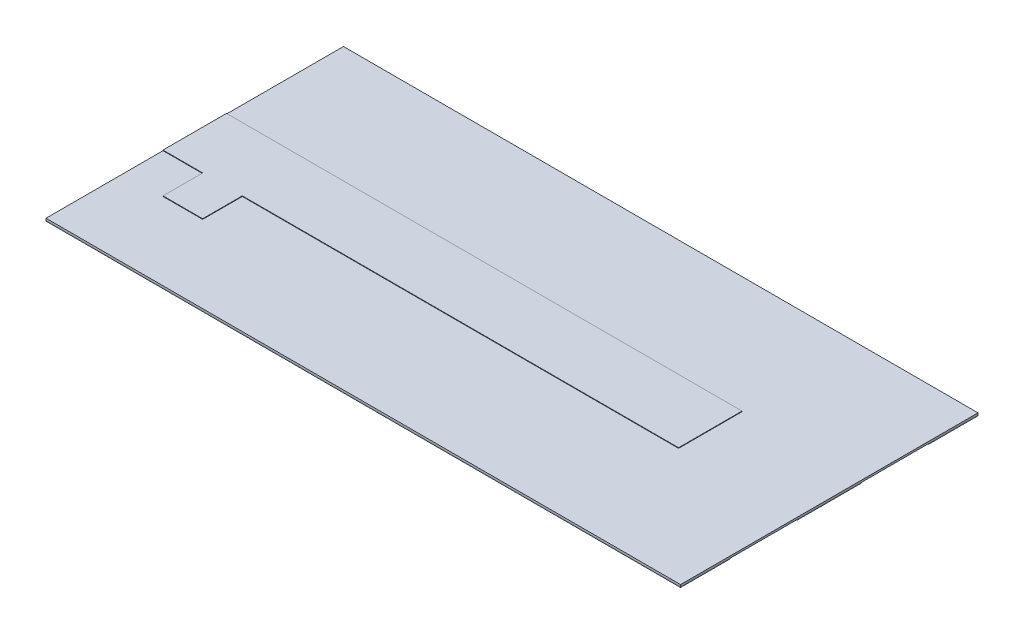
ISO-10303-21;
HEADER;
FILE_DESCRIPTION(('STEP AP214'),'2;1');
FILE_NAME('part.step','',(''),(''),'','','');
FILE_SCHEMA(('AUTOMOTIVE_DESIGN { 1 0 10303 214 1 1 1 1 }'));
ENDSEC;
DATA;
#1=APPLICATION_CONTEXT('core data for automotive mechanical design processes');
#2=APPLICATION_PROTOCOL_DEFINITION('international standard','automotive_design',2000,#1);
#3=PRODUCT_CONTEXT('',#1,'mechanical');
#4=PRODUCT('Part','Part','',(#3));
#5=PRODUCT_RELATED_PRODUCT_CATEGORY('part','',(#4));
#6=PRODUCT_DEFINITION_FORMATION('','',#4);
#7=PRODUCT_DEFINITION_CONTEXT('part definition',#1,'design');
#8=PRODUCT_DEFINITION('design','',#6,#7);
#9=PRODUCT_DEFINITION_SHAPE('','',#8);
#10=(LENGTH_UNIT() NAMED_UNIT(*) SI_UNIT(.MILLI.,.METRE.));
#11=(NAMED_UNIT(*) PLANE_ANGLE_UNIT() SI_UNIT($,.RADIAN.));
#12=(NAMED_UNIT(*) SI_UNIT($,.STERADIAN.) SOLID_ANGLE_UNIT());
#13=UNCERTAINTY_MEASURE_WITH_UNIT(LENGTH_MEASURE(1.E-05),#10,'distance_accuracy_value','');
#14=(GEOMETRIC_REPRESENTATION_CONTEXT(3) GLOBAL_UNCERTAINTY_ASSIGNED_CONTEXT((#13)) GLOBAL_UNIT_ASSIGNED_CONTEXT((#10,
#11,#12)) REPRESENTATION_CONTEXT('',''));
#15=CARTESIAN_POINT('',(0.,0.,0.));
#16=DIRECTION('',(0.,0.,1.));
#17=DIRECTION('',(1.,0.,0.));
#18=AXIS2_PLACEMENT_3D('',#15,#16,#17);
#19=CARTESIAN_POINT('',(20.32,-0.03556,-9.525));
#20=DIRECTION('',(0.,0.,1.));
#21=DIRECTION('',(1.,0.,0.));
#22=AXIS2_PLACEMENT_3D('',#19,#20,#21);
#23=PLANE('',#22);
#24=DIRECTION('',(1.,0.,0.));
#25=VECTOR('',#24,1.);
#26=CARTESIAN_POINT('',(20.32,0.,-9.525));
#27=LINE('',#26,#25);
#28=CARTESIAN_POINT('',(-20.32,0.,-9.525));
#29=VERTEX_POINT('',#28);
#30=CARTESIAN_POINT('',(20.32,0.,-9.525));
#31=VERTEX_POINT('',#30);
#32=EDGE_CURVE('E114',#29,#31,#27,.T.);
#33=ORIENTED_EDGE('',*,*,#32,.T.);
#34=DIRECTION('',(0.,1.,0.));
#35=VECTOR('',#34,1.);
#36=CARTESIAN_POINT('',(20.32,-0.03556,-9.525));
#37=LINE('',#36,#35);
#38=CARTESIAN_POINT('',(20.32,-0.03556,-9.525));
#39=VERTEX_POINT('',#38);
#40=EDGE_CURVE('E12',#39,#31,#37,.T.);
#41=ORIENTED_EDGE('',*,*,#40,.F.);
#42=DIRECTION('',(1.,0.,0.));
#43=VECTOR('',#42,1.);
#44=CARTESIAN_POINT('',(20.32,-0.03556,-9.525));
#45=LINE('',#44,#43);
#46=CARTESIAN_POINT('',(-20.32,-0.03556,-9.525));
#47=VERTEX_POINT('',#46);
#48=EDGE_CURVE('E102',#47,#39,#45,.T.);
#49=ORIENTED_EDGE('',*,*,#48,.F.);
#50=DIRECTION('',(0.,1.,0.));
#51=VECTOR('',#50,1.);
#52=CARTESIAN_POINT('',(-20.32,-0.03556,-9.525));
#53=LINE('',#52,#51);
#54=EDGE_CURVE('E110',#47,#29,#53,.T.);
#55=ORIENTED_EDGE('',*,*,#54,.T.);
#56=EDGE_LOOP('',(#33,#41,#49,#55));
#57=FACE_BOUND('',#56,.T.);
#58=ADVANCED_FACE('F51',(#57),#23,.F.);
#59=CARTESIAN_POINT('',(20.32,-0.03556,-6.35));
#60=DIRECTION('',(-1.,0.,0.));
#61=DIRECTION('',(0.,0.,1.));
#62=AXIS2_PLACEMENT_3D('',#59,#60,#61);
#63=PLANE('',#62);
#64=DIRECTION('',(0.,0.,1.));
#65=VECTOR('',#64,1.);
#66=CARTESIAN_POINT('',(20.32,0.,-6.35));
#67=LINE('',#66,#65);
#68=CARTESIAN_POINT('',(20.32,0.,-6.35));
#69=VERTEX_POINT('',#68);
#70=EDGE_CURVE('E106',#31,#69,#67,.T.);
#71=ORIENTED_EDGE('',*,*,#70,.T.);
#72=DIRECTION('',(0.,1.,0.));
#73=VECTOR('',#72,1.);
#74=CARTESIAN_POINT('',(20.32,-0.03556,-6.35));
#75=LINE('',#74,#73);
#76=CARTESIAN_POINT('',(20.32,-0.03556,-6.35));
#77=VERTEX_POINT('',#76);
#78=EDGE_CURVE('E59',#77,#69,#75,.T.);
#79=ORIENTED_EDGE('',*,*,#78,.F.);
#80=DIRECTION('',(0.,0.,1.));
#81=VECTOR('',#80,1.);
#82=CARTESIAN_POINT('',(20.32,-0.03556,-6.35));
#83=LINE('',#82,#81);
#84=EDGE_CURVE('E97',#39,#77,#83,.T.);
#85=ORIENTED_EDGE('',*,*,#84,.F.);
#86=ORIENTED_EDGE('',*,*,#40,.T.);
#87=EDGE_LOOP('',(#71,#79,#85,#86));
#88=FACE_BOUND('',#87,.T.);
#89=ADVANCED_FACE('F105',(#88),#63,.F.);
#90=CARTESIAN_POINT('',(-20.32,-0.03556,-6.35));
#91=DIRECTION('',(0.,0.,-1.));
#92=DIRECTION('',(-1.,0.,0.));
#93=AXIS2_PLACEMENT_3D('',#90,#91,#92);
#94=PLANE('',#93);
#95=DIRECTION('',(-1.,0.,0.));
#96=VECTOR('',#95,1.);
#97=CARTESIAN_POINT('',(-20.32,0.,-6.35));
#98=LINE('',#97,#96);
#99=CARTESIAN_POINT('',(-20.32,0.,-6.35));
#100=VERTEX_POINT('',#99);
#101=EDGE_CURVE('E84',#69,#100,#98,.T.);
#102=ORIENTED_EDGE('',*,*,#101,.T.);
#103=DIRECTION('',(0.,1.,0.));
#104=VECTOR('',#103,1.);
#105=CARTESIAN_POINT('',(-20.32,-0.03556,-6.35));
#106=LINE('',#105,#104);
#107=CARTESIAN_POINT('',(-20.32,-0.03556,-6.35));
#108=VERTEX_POINT('',#107);
#109=EDGE_CURVE('E107',#108,#100,#106,.T.);
#110=ORIENTED_EDGE('',*,*,#109,.F.);
#111=DIRECTION('',(-1.,0.,0.));
#112=VECTOR('',#111,1.);
#113=CARTESIAN_POINT('',(-20.32,-0.03556,-6.35));
#114=LINE('',#113,#112);
#115=EDGE_CURVE('E100',#77,#108,#114,.T.);
#116=ORIENTED_EDGE('',*,*,#115,.F.);
#117=ORIENTED_EDGE('',*,*,#78,.T.);
#118=EDGE_LOOP('',(#102,#110,#116,#117));
#119=FACE_BOUND('',#118,.T.);
#120=ADVANCED_FACE('F108',(#119),#94,.F.);
#121=CARTESIAN_POINT('',(-20.32,-0.03556,-9.525));
#122=DIRECTION('',(1.,0.,0.));
#123=DIRECTION('',(0.,0.,-1.));
#124=AXIS2_PLACEMENT_3D('',#121,#122,#123);
#125=PLANE('',#124);
#126=DIRECTION('',(0.,0.,-1.));
#127=VECTOR('',#126,1.);
#128=CARTESIAN_POINT('',(-20.32,0.,-9.525));
#129=LINE('',#128,#127);
#130=EDGE_CURVE('E90',#100,#29,#129,.T.);
#131=ORIENTED_EDGE('',*,*,#130,.T.);
#132=ORIENTED_EDGE('',*,*,#54,.F.);
#133=DIRECTION('',(0.,0.,-1.));
#134=VECTOR('',#133,1.);
#135=CARTESIAN_POINT('',(-20.32,-0.03556,-9.525));
#136=LINE('',#135,#134);
#137=EDGE_CURVE('E67',#108,#47,#136,.T.);
#138=ORIENTED_EDGE('',*,*,#137,.F.);
#139=ORIENTED_EDGE('',*,*,#109,.T.);
#140=EDGE_LOOP('',(#131,#132,#138,#139));
#141=FACE_BOUND('',#140,.T.);
#142=ADVANCED_FACE('F121',(#141),#125,.F.);
#143=CARTESIAN_POINT('',(0.,-0.03556,0.));
#144=DIRECTION('',(0.,1.,0.));
#145=DIRECTION('',(0.,0.,1.));
#146=AXIS2_PLACEMENT_3D('',#143,#144,#145);
#147=PLANE('',#146);
#148=ORIENTED_EDGE('',*,*,#48,.T.);
#149=ORIENTED_EDGE('',*,*,#84,.T.);
#150=ORIENTED_EDGE('',*,*,#115,.T.);
#151=ORIENTED_EDGE('',*,*,#137,.T.);
#152=EDGE_LOOP('',(#148,#149,#150,#151));
#153=FACE_BOUND('',#152,.T.);
#154=ADVANCED_FACE('F98',(#153),#147,.F.);
#155=CARTESIAN_POINT('',(0.,0.,0.));
#156=DIRECTION('',(0.,1.,0.));
#157=DIRECTION('',(0.,0.,1.));
#158=AXIS2_PLACEMENT_3D('',#155,#156,#157);
#159=PLANE('',#158);
#160=ORIENTED_EDGE('',*,*,#32,.F.);
#161=ORIENTED_EDGE('',*,*,#130,.F.);
#162=ORIENTED_EDGE('',*,*,#101,.F.);
#163=ORIENTED_EDGE('',*,*,#70,.F.);
#164=EDGE_LOOP('',(#160,#161,#162,#163));
#165=FACE_BOUND('',#164,.T.);
#166=ADVANCED_FACE('F124',(#165),#159,.T.);
#167=CLOSED_SHELL('',(#58,#89,#120,#142,#154,#166));
#168=MANIFOLD_SOLID_BREP('B2',#167);
#169=CARTESIAN_POINT('',(20.32,-0.03556,6.35));
#170=DIRECTION('',(-1.,0.,0.));
#171=DIRECTION('',(0.,0.,1.));
#172=AXIS2_PLACEMENT_3D('',#169,#170,#171);
#173=PLANE('',#172);
#174=DIRECTION('',(0.,0.,1.));
#175=VECTOR('',#174,1.);
#176=CARTESIAN_POINT('',(20.32,0.,6.35));
#177=LINE('',#176,#175);
#178=CARTESIAN_POINT('',(20.32,0.,6.35));
#179=VERTEX_POINT('',#178);
#180=CARTESIAN_POINT('',(20.32,0.,9.525));
#181=VERTEX_POINT('',#180);
#182=EDGE_CURVE('E247',#179,#181,#177,.T.);
#183=ORIENTED_EDGE('',*,*,#182,.T.);
#184=DIRECTION('',(0.,1.,0.));
#185=VECTOR('',#184,1.);
#186=CARTESIAN_POINT('',(20.32,-0.03556,9.525));
#187=LINE('',#186,#185);
#188=CARTESIAN_POINT('',(20.32,-0.03556,9.525));
#189=VERTEX_POINT('',#188);
#190=EDGE_CURVE('E49',#189,#181,#187,.T.);
#191=ORIENTED_EDGE('',*,*,#190,.F.);
#192=DIRECTION('',(0.,0.,1.));
#193=VECTOR('',#192,1.);
#194=CARTESIAN_POINT('',(20.32,-0.03556,6.35));
#195=LINE('',#194,#193);
#196=CARTESIAN_POINT('',(20.32,-0.03556,6.35));
#197=VERTEX_POINT('',#196);
#198=EDGE_CURVE('E235',#197,#189,#195,.T.);
#199=ORIENTED_EDGE('',*,*,#198,.F.);
#200=DIRECTION('',(0.,1.,0.));
#201=VECTOR('',#200,1.);
#202=CARTESIAN_POINT('',(20.32,-0.03556,6.35));
#203=LINE('',#202,#201);
#204=EDGE_CURVE('E243',#197,#179,#203,.T.);
#205=ORIENTED_EDGE('',*,*,#204,.T.);
#206=EDGE_LOOP('',(#183,#191,#199,#205));
#207=FACE_BOUND('',#206,.T.);
#208=ADVANCED_FACE('F184',(#207),#173,.F.);
#209=CARTESIAN_POINT('',(20.32,-0.03556,9.525));
#210=DIRECTION('',(0.,0.,-1.));
#211=DIRECTION('',(-1.,0.,0.));
#212=AXIS2_PLACEMENT_3D('',#209,#210,#211);
#213=PLANE('',#212);
#214=DIRECTION('',(-1.,0.,0.));
#215=VECTOR('',#214,1.);
#216=CARTESIAN_POINT('',(20.32,0.,9.525));
#217=LINE('',#216,#215);
#218=CARTESIAN_POINT('',(-20.32,0.,9.525));
#219=VERTEX_POINT('',#218);
#220=EDGE_CURVE('E239',#181,#219,#217,.T.);
#221=ORIENTED_EDGE('',*,*,#220,.T.);
#222=DIRECTION('',(0.,1.,0.));
#223=VECTOR('',#222,1.);
#224=CARTESIAN_POINT('',(-20.32,-0.03556,9.525));
#225=LINE('',#224,#223);
#226=CARTESIAN_POINT('',(-20.32,-0.03556,9.525));
#227=VERTEX_POINT('',#226);
#228=EDGE_CURVE('E192',#227,#219,#225,.T.);
#229=ORIENTED_EDGE('',*,*,#228,.F.);
#230=DIRECTION('',(-1.,0.,0.));
#231=VECTOR('',#230,1.);
#232=CARTESIAN_POINT('',(20.32,-0.03556,9.525));
#233=LINE('',#232,#231);
#234=EDGE_CURVE('E230',#189,#227,#233,.T.);
#235=ORIENTED_EDGE('',*,*,#234,.F.);
#236=ORIENTED_EDGE('',*,*,#190,.T.);
#237=EDGE_LOOP('',(#221,#229,#235,#236));
#238=FACE_BOUND('',#237,.T.);
#239=ADVANCED_FACE('F238',(#238),#213,.F.);
#240=CARTESIAN_POINT('',(-20.32,-0.03556,9.525));
#241=DIRECTION('',(1.,0.,0.));
#242=DIRECTION('',(0.,0.,-1.));
#243=AXIS2_PLACEMENT_3D('',#240,#241,#242);
#244=PLANE('',#243);
#245=DIRECTION('',(0.,0.,-1.));
#246=VECTOR('',#245,1.);
#247=CARTESIAN_POINT('',(-20.32,0.,9.525));
#248=LINE('',#247,#246);
#249=CARTESIAN_POINT('',(-20.32,0.,6.35));
#250=VERTEX_POINT('',#249);
#251=EDGE_CURVE('E217',#219,#250,#248,.T.);
#252=ORIENTED_EDGE('',*,*,#251,.T.);
#253=DIRECTION('',(0.,1.,0.));
#254=VECTOR('',#253,1.);
#255=CARTESIAN_POINT('',(-20.32,-0.03556,6.35));
#256=LINE('',#255,#254);
#257=CARTESIAN_POINT('',(-20.32,-0.03556,6.35));
#258=VERTEX_POINT('',#257);
#259=EDGE_CURVE('E240',#258,#250,#256,.T.);
#260=ORIENTED_EDGE('',*,*,#259,.F.);
#261=DIRECTION('',(0.,0.,-1.));
#262=VECTOR('',#261,1.);
#263=CARTESIAN_POINT('',(-20.32,-0.03556,9.525));
#264=LINE('',#263,#262);
#265=EDGE_CURVE('E233',#227,#258,#264,.T.);
#266=ORIENTED_EDGE('',*,*,#265,.F.);
#267=ORIENTED_EDGE('',*,*,#228,.T.);
#268=EDGE_LOOP('',(#252,#260,#266,#267));
#269=FACE_BOUND('',#268,.T.);
#270=ADVANCED_FACE('F241',(#269),#244,.F.);
#271=CARTESIAN_POINT('',(-20.32,-0.03556,6.35));
#272=DIRECTION('',(0.,0.,1.));
#273=DIRECTION('',(1.,0.,0.));
#274=AXIS2_PLACEMENT_3D('',#271,#272,#273);
#275=PLANE('',#274);
#276=DIRECTION('',(1.,0.,0.));
#277=VECTOR('',#276,1.);
#278=CARTESIAN_POINT('',(-20.32,0.,6.35));
#279=LINE('',#278,#277);
#280=EDGE_CURVE('E223',#250,#179,#279,.T.);
#281=ORIENTED_EDGE('',*,*,#280,.T.);
#282=ORIENTED_EDGE('',*,*,#204,.F.);
#283=DIRECTION('',(1.,0.,0.));
#284=VECTOR('',#283,1.);
#285=CARTESIAN_POINT('',(-20.32,-0.03556,6.35));
#286=LINE('',#285,#284);
#287=EDGE_CURVE('E200',#258,#197,#286,.T.);
#288=ORIENTED_EDGE('',*,*,#287,.F.);
#289=ORIENTED_EDGE('',*,*,#259,.T.);
#290=EDGE_LOOP('',(#281,#282,#288,#289));
#291=FACE_BOUND('',#290,.T.);
#292=ADVANCED_FACE('F254',(#291),#275,.F.);
#293=CARTESIAN_POINT('',(0.,-0.03556,0.));
#294=DIRECTION('',(0.,-1.,0.));
#295=DIRECTION('',(0.,0.,-1.));
#296=AXIS2_PLACEMENT_3D('',#293,#294,#295);
#297=PLANE('',#296);
#298=ORIENTED_EDGE('',*,*,#198,.T.);
#299=ORIENTED_EDGE('',*,*,#234,.T.);
#300=ORIENTED_EDGE('',*,*,#265,.T.);
#301=ORIENTED_EDGE('',*,*,#287,.T.);
#302=EDGE_LOOP('',(#298,#299,#300,#301));
#303=FACE_BOUND('',#302,.T.);
#304=ADVANCED_FACE('F231',(#303),#297,.T.);
#305=CARTESIAN_POINT('',(0.,0.,0.));
#306=DIRECTION('',(0.,-1.,0.));
#307=DIRECTION('',(0.,0.,-1.));
#308=AXIS2_PLACEMENT_3D('',#305,#306,#307);
#309=PLANE('',#308);
#310=ORIENTED_EDGE('',*,*,#182,.F.);
#311=ORIENTED_EDGE('',*,*,#280,.F.);
#312=ORIENTED_EDGE('',*,*,#251,.F.);
#313=ORIENTED_EDGE('',*,*,#220,.F.);
#314=EDGE_LOOP('',(#310,#311,#312,#313));
#315=FACE_BOUND('',#314,.T.);
#316=ADVANCED_FACE('F257',(#315),#309,.F.);
#317=CLOSED_SHELL('',(#208,#239,#270,#292,#304,#316));
#318=MANIFOLD_SOLID_BREP('B6',#317);
#319=CARTESIAN_POINT('',(20.32,-0.03556,2.032));
#320=DIRECTION('',(-1.,0.,0.));
#321=DIRECTION('',(0.,0.,1.));
#322=AXIS2_PLACEMENT_3D('',#319,#320,#321);
#323=PLANE('',#322);
#324=DIRECTION('',(0.,0.,1.));
#325=VECTOR('',#324,1.);
#326=CARTESIAN_POINT('',(20.32,0.,2.032));
#327=LINE('',#326,#325);
#328=CARTESIAN_POINT('',(20.32,0.,-2.032));
#329=VERTEX_POINT('',#328);
#330=CARTESIAN_POINT('',(20.32,0.,2.032));
#331=VERTEX_POINT('',#330);
#332=EDGE_CURVE('E379',#329,#331,#327,.T.);
#333=ORIENTED_EDGE('',*,*,#332,.T.);
#334=DIRECTION('',(0.,1.,0.));
#335=VECTOR('',#334,1.);
#336=CARTESIAN_POINT('',(20.32,-0.03556,2.032));
#337=LINE('',#336,#335);
#338=CARTESIAN_POINT('',(20.32,-0.03556,2.032));
#339=VERTEX_POINT('',#338);
#340=EDGE_CURVE('E182',#339,#331,#337,.T.);
#341=ORIENTED_EDGE('',*,*,#340,.F.);
#342=DIRECTION('',(0.,0.,1.));
#343=VECTOR('',#342,1.);
#344=CARTESIAN_POINT('',(20.32,-0.03556,2.032));
#345=LINE('',#344,#343);
#346=CARTESIAN_POINT('',(20.32,-0.03556,-2.032));
#347=VERTEX_POINT('',#346);
#348=EDGE_CURVE('E367',#347,#339,#345,.T.);
#349=ORIENTED_EDGE('',*,*,#348,.F.);
#350=DIRECTION('',(0.,1.,0.));
#351=VECTOR('',#350,1.);
#352=CARTESIAN_POINT('',(20.32,-0.03556,-2.032));
#353=LINE('',#352,#351);
#354=EDGE_CURVE('E375',#347,#329,#353,.T.);
#355=ORIENTED_EDGE('',*,*,#354,.T.);
#356=EDGE_LOOP('',(#333,#341,#349,#355));
#357=FACE_BOUND('',#356,.T.);
#358=ADVANCED_FACE('F316',(#357),#323,.F.);
#359=CARTESIAN_POINT('',(-2.921,-0.03556,2.032));
#360=DIRECTION('',(0.,0.,-1.));
#361=DIRECTION('',(-1.,0.,0.));
#362=AXIS2_PLACEMENT_3D('',#359,#360,#361);
#363=PLANE('',#362);
#364=DIRECTION('',(-1.,0.,0.));
#365=VECTOR('',#364,1.);
#366=CARTESIAN_POINT('',(-2.921,0.,2.032));
#367=LINE('',#366,#365);
#368=CARTESIAN_POINT('',(-2.921,0.,2.032));
#369=VERTEX_POINT('',#368);
#370=EDGE_CURVE('E371',#331,#369,#367,.T.);
#371=ORIENTED_EDGE('',*,*,#370,.T.);
#372=DIRECTION('',(0.,1.,0.));
#373=VECTOR('',#372,1.);
#374=CARTESIAN_POINT('',(-2.921,-0.03556,2.032));
#375=LINE('',#374,#373);
#376=CARTESIAN_POINT('',(-2.921,-0.03556,2.032));
#377=VERTEX_POINT('',#376);
#378=EDGE_CURVE('E324',#377,#369,#375,.T.);
#379=ORIENTED_EDGE('',*,*,#378,.F.);
#380=DIRECTION('',(-1.,0.,0.));
#381=VECTOR('',#380,1.);
#382=CARTESIAN_POINT('',(-2.921,-0.03556,2.032));
#383=LINE('',#382,#381);
#384=EDGE_CURVE('E362',#339,#377,#383,.T.);
#385=ORIENTED_EDGE('',*,*,#384,.F.);
#386=ORIENTED_EDGE('',*,*,#340,.T.);
#387=EDGE_LOOP('',(#371,#379,#385,#386));
#388=FACE_BOUND('',#387,.T.);
#389=ADVANCED_FACE('F370',(#388),#363,.F.);
#390=CARTESIAN_POINT('',(-2.921,-0.03556,-2.032));
#391=DIRECTION('',(1.,0.,0.));
#392=DIRECTION('',(0.,0.,-1.));
#393=AXIS2_PLACEMENT_3D('',#390,#391,#392);
#394=PLANE('',#393);
#395=DIRECTION('',(0.,0.,-1.));
#396=VECTOR('',#395,1.);
#397=CARTESIAN_POINT('',(-2.921,0.,-2.032));
#398=LINE('',#397,#396);
#399=CARTESIAN_POINT('',(-2.921,0.,-2.032));
#400=VERTEX_POINT('',#399);
#401=EDGE_CURVE('E349',#369,#400,#398,.T.);
#402=ORIENTED_EDGE('',*,*,#401,.T.);
#403=DIRECTION('',(0.,1.,0.));
#404=VECTOR('',#403,1.);
#405=CARTESIAN_POINT('',(-2.921,-0.03556,-2.032));
#406=LINE('',#405,#404);
#407=CARTESIAN_POINT('',(-2.921,-0.03556,-2.032));
#408=VERTEX_POINT('',#407);
#409=EDGE_CURVE('E372',#408,#400,#406,.T.);
#410=ORIENTED_EDGE('',*,*,#409,.F.);
#411=DIRECTION('',(0.,0.,-1.));
#412=VECTOR('',#411,1.);
#413=CARTESIAN_POINT('',(-2.921,-0.03556,-2.032));
#414=LINE('',#413,#412);
#415=EDGE_CURVE('E365',#377,#408,#414,.T.);
#416=ORIENTED_EDGE('',*,*,#415,.F.);
#417=ORIENTED_EDGE('',*,*,#378,.T.);
#418=EDGE_LOOP('',(#402,#410,#416,#417));
#419=FACE_BOUND('',#418,.T.);
#420=ADVANCED_FACE('F373',(#419),#394,.F.);
#421=CARTESIAN_POINT('',(20.32,-0.03556,-2.032));
#422=DIRECTION('',(0.,0.,1.));
#423=DIRECTION('',(1.,0.,0.));
#424=AXIS2_PLACEMENT_3D('',#421,#422,#423);
#425=PLANE('',#424);
#426=DIRECTION('',(1.,0.,0.));
#427=VECTOR('',#426,1.);
#428=CARTESIAN_POINT('',(20.32,0.,-2.032));
#429=LINE('',#428,#427);
#430=EDGE_CURVE('E355',#400,#329,#429,.T.);
#431=ORIENTED_EDGE('',*,*,#430,.T.);
#432=ORIENTED_EDGE('',*,*,#354,.F.);
#433=DIRECTION('',(1.,0.,0.));
#434=VECTOR('',#433,1.);
#435=CARTESIAN_POINT('',(20.32,-0.03556,-2.032));
#436=LINE('',#435,#434);
#437=EDGE_CURVE('E332',#408,#347,#436,.T.);
#438=ORIENTED_EDGE('',*,*,#437,.F.);
#439=ORIENTED_EDGE('',*,*,#409,.T.);
#440=EDGE_LOOP('',(#431,#432,#438,#439));
#441=FACE_BOUND('',#440,.T.);
#442=ADVANCED_FACE('F386',(#441),#425,.F.);
#443=CARTESIAN_POINT('',(0.,-0.03556,0.));
#444=DIRECTION('',(0.,1.,0.));
#445=DIRECTION('',(0.,0.,1.));
#446=AXIS2_PLACEMENT_3D('',#443,#444,#445);
#447=PLANE('',#446);
#448=ORIENTED_EDGE('',*,*,#348,.T.);
#449=ORIENTED_EDGE('',*,*,#384,.T.);
#450=ORIENTED_EDGE('',*,*,#415,.T.);
#451=ORIENTED_EDGE('',*,*,#437,.T.);
#452=EDGE_LOOP('',(#448,#449,#450,#451));
#453=FACE_BOUND('',#452,.T.);
#454=ADVANCED_FACE('F363',(#453),#447,.F.);
#455=CARTESIAN_POINT('',(0.,0.,0.));
#456=DIRECTION('',(0.,1.,0.));
#457=DIRECTION('',(0.,0.,1.));
#458=AXIS2_PLACEMENT_3D('',#455,#456,#457);
#459=PLANE('',#458);
#460=ORIENTED_EDGE('',*,*,#332,.F.);
#461=ORIENTED_EDGE('',*,*,#430,.F.);
#462=ORIENTED_EDGE('',*,*,#401,.F.);
#463=ORIENTED_EDGE('',*,*,#370,.F.);
#464=EDGE_LOOP('',(#460,#461,#462,#463));
#465=FACE_BOUND('',#464,.T.);
#466=ADVANCED_FACE('F389',(#465),#459,.T.);
#467=CLOSED_SHELL('',(#358,#389,#420,#442,#454,#466));
#468=MANIFOLD_SOLID_BREP('B43',#467);
#469=CARTESIAN_POINT('',(0.,0.127,0.));
#470=DIRECTION('',(0.,1.,0.));
#471=DIRECTION('',(0.,0.,1.));
#472=AXIS2_PLACEMENT_3D('',#469,#470,#471);
#473=PLANE('',#472);
#474=DIRECTION('',(0.,0.,1.));
#475=VECTOR('',#474,1.);
#476=CARTESIAN_POINT('',(-17.78,0.127,2.032));
#477=LINE('',#476,#475);
#478=CARTESIAN_POINT('',(-17.78,0.127,2.032));
#479=VERTEX_POINT('',#478);
#480=CARTESIAN_POINT('',(-17.78,0.127,4.572));
#481=VERTEX_POINT('',#480);
#482=EDGE_CURVE('E567',#479,#481,#477,.T.);
#483=ORIENTED_EDGE('',*,*,#482,.F.);
#484=DIRECTION('',(1.,0.,0.));
#485=VECTOR('',#484,1.);
#486=CARTESIAN_POINT('',(12.7,0.127,2.03199999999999));
#487=LINE('',#486,#485);
#488=CARTESIAN_POINT('',(-20.32,0.127,2.032));
#489=VERTEX_POINT('',#488);
#490=EDGE_CURVE('E673',#489,#479,#487,.T.);
#491=ORIENTED_EDGE('',*,*,#490,.F.);
#492=DIRECTION('',(0.,0.,1.));
#493=VECTOR('',#492,1.);
#494=CARTESIAN_POINT('',(-20.32,0.127,-9.525));
#495=LINE('',#494,#493);
#496=CARTESIAN_POINT('',(-20.32,0.127,9.525));
#497=VERTEX_POINT('',#496);
#498=EDGE_CURVE('E566',#489,#497,#495,.T.);
#499=ORIENTED_EDGE('',*,*,#498,.T.);
#500=DIRECTION('',(1.,0.,0.));
#501=VECTOR('',#500,1.);
#502=CARTESIAN_POINT('',(-20.32,0.127,9.525));
#503=LINE('',#502,#501);
#504=CARTESIAN_POINT('',(20.32,0.127,9.525));
#505=VERTEX_POINT('',#504);
#506=EDGE_CURVE('E464',#497,#505,#503,.T.);
#507=ORIENTED_EDGE('',*,*,#506,.T.);
#508=DIRECTION('',(0.,0.,-1.));
#509=VECTOR('',#508,1.);
#510=CARTESIAN_POINT('',(20.32,0.127,-9.525));
#511=LINE('',#510,#509);
#512=CARTESIAN_POINT('',(20.32,0.127,-9.525));
#513=VERTEX_POINT('',#512);
#514=EDGE_CURVE('E594',#505,#513,#511,.T.);
#515=ORIENTED_EDGE('',*,*,#514,.T.);
#516=DIRECTION('',(-1.,0.,0.));
#517=VECTOR('',#516,1.);
#518=CARTESIAN_POINT('',(-20.32,0.127,-9.525));
#519=LINE('',#518,#517);
#520=CARTESIAN_POINT('',(-20.32,0.127,-9.525));
#521=VERTEX_POINT('',#520);
#522=EDGE_CURVE('E492',#513,#521,#519,.T.);
#523=ORIENTED_EDGE('',*,*,#522,.T.);
#524=CARTESIAN_POINT('',(-20.32,0.127,-2.032));
#525=VERTEX_POINT('',#524);
#526=EDGE_CURVE('E597',#521,#525,#495,.T.);
#527=ORIENTED_EDGE('',*,*,#526,.T.);
#528=DIRECTION('',(-1.,0.,0.));
#529=VECTOR('',#528,1.);
#530=CARTESIAN_POINT('',(-20.32,0.127,-2.032));
#531=LINE('',#530,#529);
#532=CARTESIAN_POINT('',(12.7,0.127,-2.032));
#533=VERTEX_POINT('',#532);
#534=EDGE_CURVE('E561',#533,#525,#531,.T.);
#535=ORIENTED_EDGE('',*,*,#534,.F.);
#536=DIRECTION('',(0.,0.,-1.));
#537=VECTOR('',#536,1.);
#538=CARTESIAN_POINT('',(12.7,0.127,-2.032));
#539=LINE('',#538,#537);
#540=CARTESIAN_POINT('',(12.7,0.127,2.03199999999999));
#541=VERTEX_POINT('',#540);
#542=EDGE_CURVE('E667',#541,#533,#539,.T.);
#543=ORIENTED_EDGE('',*,*,#542,.F.);
#544=CARTESIAN_POINT('',(-15.24,0.127,2.032));
#545=VERTEX_POINT('',#544);
#546=EDGE_CURVE('E674',#545,#541,#487,.T.);
#547=ORIENTED_EDGE('',*,*,#546,.F.);
#548=DIRECTION('',(0.,0.,-1.));
#549=VECTOR('',#548,1.);
#550=CARTESIAN_POINT('',(-15.24,0.127,4.572));
#551=LINE('',#550,#549);
#552=CARTESIAN_POINT('',(-15.24,0.127,4.572));
#553=VERTEX_POINT('',#552);
#554=EDGE_CURVE('E580',#553,#545,#551,.T.);
#555=ORIENTED_EDGE('',*,*,#554,.F.);
#556=DIRECTION('',(1.,0.,0.));
#557=VECTOR('',#556,1.);
#558=CARTESIAN_POINT('',(-17.78,0.127,4.572));
#559=LINE('',#558,#557);
#560=EDGE_CURVE('E570',#481,#553,#559,.T.);
#561=ORIENTED_EDGE('',*,*,#560,.F.);
#562=EDGE_LOOP('',(#483,#491,#499,#507,#515,#523,#527,#535,#543,#547,#555,#561));
#563=FACE_BOUND('',#562,.T.);
#564=ADVANCED_FACE('F440',(#563),#473,.T.);
#565=CARTESIAN_POINT('',(20.32,0.127,-9.525));
#566=DIRECTION('',(-1.,0.,0.));
#567=DIRECTION('',(0.,0.,1.));
#568=AXIS2_PLACEMENT_3D('',#565,#566,#567);
#569=PLANE('',#568);
#570=DIRECTION('',(0.,0.,-1.));
#571=VECTOR('',#570,1.);
#572=CARTESIAN_POINT('',(20.32,0.,-9.525));
#573=LINE('',#572,#571);
#574=CARTESIAN_POINT('',(20.32,0.,9.525));
#575=VERTEX_POINT('',#574);
#576=CARTESIAN_POINT('',(20.32,0.,-9.525));
#577=VERTEX_POINT('',#576);
#578=EDGE_CURVE('E593',#575,#577,#573,.T.);
#579=ORIENTED_EDGE('',*,*,#578,.T.);
#580=DIRECTION('',(0.,-1.,0.));
#581=VECTOR('',#580,1.);
#582=CARTESIAN_POINT('',(20.32,0.127,-9.525));
#583=LINE('',#582,#581);
#584=EDGE_CURVE('E314',#513,#577,#583,.T.);
#585=ORIENTED_EDGE('',*,*,#584,.F.);
#586=ORIENTED_EDGE('',*,*,#514,.F.);
#587=DIRECTION('',(0.,-1.,0.));
#588=VECTOR('',#587,1.);
#589=CARTESIAN_POINT('',(20.32,0.127,9.525));
#590=LINE('',#589,#588);
#591=EDGE_CURVE('E601',#505,#575,#590,.T.);
#592=ORIENTED_EDGE('',*,*,#591,.T.);
#593=EDGE_LOOP('',(#579,#585,#586,#592));
#594=FACE_BOUND('',#593,.T.);
#595=ADVANCED_FACE('F442',(#594),#569,.F.);
#596=CARTESIAN_POINT('',(-20.32,0.127,-9.525));
#597=DIRECTION('',(0.,0.,1.));
#598=DIRECTION('',(1.,0.,0.));
#599=AXIS2_PLACEMENT_3D('',#596,#597,#598);
#600=PLANE('',#599);
#601=DIRECTION('',(-1.,0.,0.));
#602=VECTOR('',#601,1.);
#603=CARTESIAN_POINT('',(-20.32,0.,-9.525));
#604=LINE('',#603,#602);
#605=CARTESIAN_POINT('',(-20.32,0.,-9.525));
#606=VERTEX_POINT('',#605);
#607=EDGE_CURVE('E604',#577,#606,#604,.T.);
#608=ORIENTED_EDGE('',*,*,#607,.T.);
#609=DIRECTION('',(0.,-1.,0.));
#610=VECTOR('',#609,1.);
#611=CARTESIAN_POINT('',(-20.32,0.127,-9.525));
#612=LINE('',#611,#610);
#613=EDGE_CURVE('E448',#521,#606,#612,.T.);
#614=ORIENTED_EDGE('',*,*,#613,.F.);
#615=ORIENTED_EDGE('',*,*,#522,.F.);
#616=ORIENTED_EDGE('',*,*,#584,.T.);
#617=EDGE_LOOP('',(#608,#614,#615,#616));
#618=FACE_BOUND('',#617,.T.);
#619=ADVANCED_FACE('F629',(#618),#600,.F.);
#620=CARTESIAN_POINT('',(-20.32,0.127,-9.525));
#621=DIRECTION('',(1.,0.,0.));
#622=DIRECTION('',(0.,0.,-1.));
#623=AXIS2_PLACEMENT_3D('',#620,#621,#622);
#624=PLANE('',#623);
#625=DIRECTION('',(0.,0.,1.));
#626=VECTOR('',#625,1.);
#627=CARTESIAN_POINT('',(-20.32,0.,-9.525));
#628=LINE('',#627,#626);
#629=CARTESIAN_POINT('',(-20.32,0.,9.525));
#630=VERTEX_POINT('',#629);
#631=EDGE_CURVE('E606',#606,#630,#628,.T.);
#632=ORIENTED_EDGE('',*,*,#631,.T.);
#633=DIRECTION('',(0.,-1.,0.));
#634=VECTOR('',#633,1.);
#635=CARTESIAN_POINT('',(-20.32,0.127,9.525));
#636=LINE('',#635,#634);
#637=EDGE_CURVE('E610',#497,#630,#636,.T.);
#638=ORIENTED_EDGE('',*,*,#637,.F.);
#639=ORIENTED_EDGE('',*,*,#498,.F.);
#640=DIRECTION('',(0.,-1.,0.));
#641=VECTOR('',#640,1.);
#642=CARTESIAN_POINT('',(-20.32,0.16256,2.032));
#643=LINE('',#642,#641);
#644=CARTESIAN_POINT('',(-20.32,0.16256,2.032));
#645=VERTEX_POINT('',#644);
#646=EDGE_CURVE('E543',#645,#489,#643,.T.);
#647=ORIENTED_EDGE('',*,*,#646,.F.);
#648=DIRECTION('',(0.,0.,1.));
#649=VECTOR('',#648,1.);
#650=CARTESIAN_POINT('',(-20.32,0.16256,2.032));
#651=LINE('',#650,#649);
#652=CARTESIAN_POINT('',(-20.32,0.16256,-2.032));
#653=VERTEX_POINT('',#652);
#654=EDGE_CURVE('E553',#653,#645,#651,.T.);
#655=ORIENTED_EDGE('',*,*,#654,.F.);
#656=DIRECTION('',(0.,-1.,0.));
#657=VECTOR('',#656,1.);
#658=CARTESIAN_POINT('',(-20.32,0.16256,-2.032));
#659=LINE('',#658,#657);
#660=EDGE_CURVE('E664',#653,#525,#659,.T.);
#661=ORIENTED_EDGE('',*,*,#660,.T.);
#662=ORIENTED_EDGE('',*,*,#526,.F.);
#663=ORIENTED_EDGE('',*,*,#613,.T.);
#664=EDGE_LOOP('',(#632,#638,#639,#647,#655,#661,#662,#663));
#665=FACE_BOUND('',#664,.T.);
#666=ADVANCED_FACE('F564',(#665),#624,.F.);
#667=CARTESIAN_POINT('',(-20.32,0.127,9.525));
#668=DIRECTION('',(0.,0.,-1.));
#669=DIRECTION('',(-1.,0.,0.));
#670=AXIS2_PLACEMENT_3D('',#667,#668,#669);
#671=PLANE('',#670);
#672=DIRECTION('',(1.,0.,0.));
#673=VECTOR('',#672,1.);
#674=CARTESIAN_POINT('',(-20.32,0.,9.525));
#675=LINE('',#674,#673);
#676=EDGE_CURVE('E485',#630,#575,#675,.T.);
#677=ORIENTED_EDGE('',*,*,#676,.T.);
#678=ORIENTED_EDGE('',*,*,#591,.F.);
#679=ORIENTED_EDGE('',*,*,#506,.F.);
#680=ORIENTED_EDGE('',*,*,#637,.T.);
#681=EDGE_LOOP('',(#677,#678,#679,#680));
#682=FACE_BOUND('',#681,.T.);
#683=ADVANCED_FACE('F620',(#682),#671,.F.);
#684=CARTESIAN_POINT('',(0.,0.,0.));
#685=DIRECTION('',(0.,1.,0.));
#686=DIRECTION('',(0.,0.,1.));
#687=AXIS2_PLACEMENT_3D('',#684,#685,#686);
#688=PLANE('',#687);
#689=ORIENTED_EDGE('',*,*,#578,.F.);
#690=ORIENTED_EDGE('',*,*,#676,.F.);
#691=ORIENTED_EDGE('',*,*,#631,.F.);
#692=ORIENTED_EDGE('',*,*,#607,.F.);
#693=EDGE_LOOP('',(#689,#690,#691,#692));
#694=FACE_BOUND('',#693,.T.);
#695=ADVANCED_FACE('F616',(#694),#688,.F.);
#696=CARTESIAN_POINT('',(-17.78,0.16256,2.032));
#697=DIRECTION('',(1.,0.,0.));
#698=DIRECTION('',(0.,0.,-1.));
#699=AXIS2_PLACEMENT_3D('',#696,#697,#698);
#700=PLANE('',#699);
#701=ORIENTED_EDGE('',*,*,#482,.T.);
#702=DIRECTION('',(0.,-1.,0.));
#703=VECTOR('',#702,1.);
#704=CARTESIAN_POINT('',(-17.78,0.16256,4.572));
#705=LINE('',#704,#703);
#706=CARTESIAN_POINT('',(-17.78,0.16256,4.572));
#707=VERTEX_POINT('',#706);
#708=EDGE_CURVE('E589',#707,#481,#705,.T.);
#709=ORIENTED_EDGE('',*,*,#708,.F.);
#710=DIRECTION('',(0.,0.,1.));
#711=VECTOR('',#710,1.);
#712=CARTESIAN_POINT('',(-17.78,0.16256,2.032));
#713=LINE('',#712,#711);
#714=CARTESIAN_POINT('',(-17.78,0.16256,2.032));
#715=VERTEX_POINT('',#714);
#716=EDGE_CURVE('E577',#715,#707,#713,.T.);
#717=ORIENTED_EDGE('',*,*,#716,.F.);
#718=DIRECTION('',(0.,-1.,0.));
#719=VECTOR('',#718,1.);
#720=CARTESIAN_POINT('',(-17.78,0.16256,2.032));
#721=LINE('',#720,#719);
#722=EDGE_CURVE('E546',#715,#479,#721,.T.);
#723=ORIENTED_EDGE('',*,*,#722,.T.);
#724=EDGE_LOOP('',(#701,#709,#717,#723));
#725=FACE_BOUND('',#724,.T.);
#726=ADVANCED_FACE('F627',(#725),#700,.F.);
#727=CARTESIAN_POINT('',(-17.78,0.16256,4.572));
#728=DIRECTION('',(0.,0.,-1.));
#729=DIRECTION('',(-1.,0.,0.));
#730=AXIS2_PLACEMENT_3D('',#727,#728,#729);
#731=PLANE('',#730);
#732=ORIENTED_EDGE('',*,*,#560,.T.);
#733=DIRECTION('',(0.,-1.,0.));
#734=VECTOR('',#733,1.);
#735=CARTESIAN_POINT('',(-15.24,0.16256,4.572));
#736=LINE('',#735,#734);
#737=CARTESIAN_POINT('',(-15.24,0.16256,4.572));
#738=VERTEX_POINT('',#737);
#739=EDGE_CURVE('E455',#738,#553,#736,.T.);
#740=ORIENTED_EDGE('',*,*,#739,.F.);
#741=DIRECTION('',(1.,0.,0.));
#742=VECTOR('',#741,1.);
#743=CARTESIAN_POINT('',(-17.78,0.16256,4.572));
#744=LINE('',#743,#742);
#745=EDGE_CURVE('E579',#707,#738,#744,.T.);
#746=ORIENTED_EDGE('',*,*,#745,.F.);
#747=ORIENTED_EDGE('',*,*,#708,.T.);
#748=EDGE_LOOP('',(#732,#740,#746,#747));
#749=FACE_BOUND('',#748,.T.);
#750=ADVANCED_FACE('F640',(#749),#731,.F.);
#751=CARTESIAN_POINT('',(-15.24,0.16256,4.572));
#752=DIRECTION('',(-1.,0.,0.));
#753=DIRECTION('',(0.,0.,1.));
#754=AXIS2_PLACEMENT_3D('',#751,#752,#753);
#755=PLANE('',#754);
#756=ORIENTED_EDGE('',*,*,#554,.T.);
#757=DIRECTION('',(0.,-1.,0.));
#758=VECTOR('',#757,1.);
#759=CARTESIAN_POINT('',(-15.24,0.16256,2.032));
#760=LINE('',#759,#758);
#761=CARTESIAN_POINT('',(-15.24,0.16256,2.032));
#762=VERTEX_POINT('',#761);
#763=EDGE_CURVE('E583',#762,#545,#760,.T.);
#764=ORIENTED_EDGE('',*,*,#763,.F.);
#765=DIRECTION('',(0.,0.,-1.));
#766=VECTOR('',#765,1.);
#767=CARTESIAN_POINT('',(-15.24,0.16256,4.572));
#768=LINE('',#767,#766);
#769=EDGE_CURVE('E582',#738,#762,#768,.T.);
#770=ORIENTED_EDGE('',*,*,#769,.F.);
#771=ORIENTED_EDGE('',*,*,#739,.T.);
#772=EDGE_LOOP('',(#756,#764,#770,#771));
#773=FACE_BOUND('',#772,.T.);
#774=ADVANCED_FACE('F644',(#773),#755,.F.);
#775=CARTESIAN_POINT('',(0.,0.16256,0.));
#776=DIRECTION('',(0.,1.,0.));
#777=DIRECTION('',(0.,0.,1.));
#778=AXIS2_PLACEMENT_3D('',#775,#776,#777);
#779=PLANE('',#778);
#780=ORIENTED_EDGE('',*,*,#769,.T.);
#781=DIRECTION('',(1.,0.,0.));
#782=VECTOR('',#781,1.);
#783=CARTESIAN_POINT('',(12.7,0.16256,2.03199999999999));
#784=LINE('',#783,#782);
#785=CARTESIAN_POINT('',(12.7,0.16256,2.03199999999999));
#786=VERTEX_POINT('',#785);
#787=EDGE_CURVE('E550',#762,#786,#784,.T.);
#788=ORIENTED_EDGE('',*,*,#787,.T.);
#789=DIRECTION('',(0.,0.,-1.));
#790=VECTOR('',#789,1.);
#791=CARTESIAN_POINT('',(12.7,0.16256,-2.032));
#792=LINE('',#791,#790);
#793=CARTESIAN_POINT('',(12.7,0.16256,-2.032));
#794=VERTEX_POINT('',#793);
#795=EDGE_CURVE('E549',#786,#794,#792,.T.);
#796=ORIENTED_EDGE('',*,*,#795,.T.);
#797=DIRECTION('',(-1.,0.,0.));
#798=VECTOR('',#797,1.);
#799=CARTESIAN_POINT('',(-20.32,0.16256,-2.032));
#800=LINE('',#799,#798);
#801=EDGE_CURVE('E557',#794,#653,#800,.T.);
#802=ORIENTED_EDGE('',*,*,#801,.T.);
#803=ORIENTED_EDGE('',*,*,#654,.T.);
#804=EDGE_CURVE('E539',#645,#715,#784,.T.);
#805=ORIENTED_EDGE('',*,*,#804,.T.);
#806=ORIENTED_EDGE('',*,*,#716,.T.);
#807=ORIENTED_EDGE('',*,*,#745,.T.);
#808=EDGE_LOOP('',(#780,#788,#796,#802,#803,#805,#806,#807));
#809=FACE_BOUND('',#808,.T.);
#810=ADVANCED_FACE('F555',(#809),#779,.T.);
#811=CARTESIAN_POINT('',(12.7,0.16256,2.03199999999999));
#812=DIRECTION('',(0.,0.,-1.));
#813=DIRECTION('',(-1.,0.,0.));
#814=AXIS2_PLACEMENT_3D('',#811,#812,#813);
#815=PLANE('',#814);
#816=ORIENTED_EDGE('',*,*,#490,.T.);
#817=ORIENTED_EDGE('',*,*,#722,.F.);
#818=ORIENTED_EDGE('',*,*,#804,.F.);
#819=ORIENTED_EDGE('',*,*,#646,.T.);
#820=EDGE_LOOP('',(#816,#817,#818,#819));
#821=FACE_BOUND('',#820,.T.);
#822=ADVANCED_FACE('F541',(#821),#815,.F.);
#823=ORIENTED_EDGE('',*,*,#787,.F.);
#824=ORIENTED_EDGE('',*,*,#763,.T.);
#825=ORIENTED_EDGE('',*,*,#546,.T.);
#826=DIRECTION('',(0.,-1.,0.));
#827=VECTOR('',#826,1.);
#828=CARTESIAN_POINT('',(12.7,0.16256,2.03199999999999));
#829=LINE('',#828,#827);
#830=EDGE_CURVE('E568',#786,#541,#829,.T.);
#831=ORIENTED_EDGE('',*,*,#830,.F.);
#832=EDGE_LOOP('',(#823,#824,#825,#831));
#833=FACE_BOUND('',#832,.T.);
#834=ADVANCED_FACE('F652',(#833),#815,.F.);
#835=CARTESIAN_POINT('',(12.7,0.16256,-2.032));
#836=DIRECTION('',(-1.,0.,0.));
#837=DIRECTION('',(0.,0.,1.));
#838=AXIS2_PLACEMENT_3D('',#835,#836,#837);
#839=PLANE('',#838);
#840=ORIENTED_EDGE('',*,*,#542,.T.);
#841=DIRECTION('',(0.,-1.,0.));
#842=VECTOR('',#841,1.);
#843=CARTESIAN_POINT('',(12.7,0.16256,-2.032));
#844=LINE('',#843,#842);
#845=EDGE_CURVE('E573',#794,#533,#844,.T.);
#846=ORIENTED_EDGE('',*,*,#845,.F.);
#847=ORIENTED_EDGE('',*,*,#795,.F.);
#848=ORIENTED_EDGE('',*,*,#830,.T.);
#849=EDGE_LOOP('',(#840,#846,#847,#848));
#850=FACE_BOUND('',#849,.T.);
#851=ADVANCED_FACE('F653',(#850),#839,.F.);
#852=CARTESIAN_POINT('',(-20.32,0.16256,-2.032));
#853=DIRECTION('',(0.,0.,1.));
#854=DIRECTION('',(1.,0.,0.));
#855=AXIS2_PLACEMENT_3D('',#852,#853,#854);
#856=PLANE('',#855);
#857=ORIENTED_EDGE('',*,*,#534,.T.);
#858=ORIENTED_EDGE('',*,*,#660,.F.);
#859=ORIENTED_EDGE('',*,*,#801,.F.);
#860=ORIENTED_EDGE('',*,*,#845,.T.);
#861=EDGE_LOOP('',(#857,#858,#859,#860));
#862=FACE_BOUND('',#861,.T.);
#863=ADVANCED_FACE('F656',(#862),#856,.F.);
#864=CLOSED_SHELL('',(#564,#595,#619,#666,#683,#695,#726,#750,#774,#810,#822,#834,#851,#863));
#865=MANIFOLD_SOLID_BREP('B176',#864);
#866=ADVANCED_BREP_SHAPE_REPRESENTATION('',(#18,#168,#318,#468,#865),#14);
#867=SHAPE_DEFINITION_REPRESENTATION(#9,#866);
ENDSEC;
END-ISO-10303-21;
